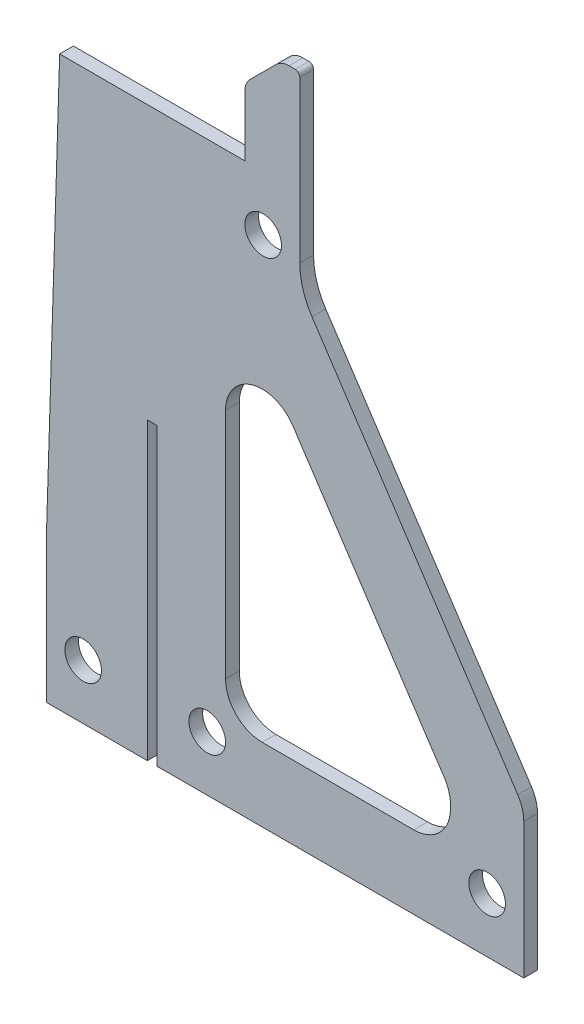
ISO-10303-21;
HEADER;
FILE_DESCRIPTION(('STEP AP214'),'2;1');
FILE_NAME('part.step','',(''),(''),'','','');
FILE_SCHEMA(('AUTOMOTIVE_DESIGN { 1 0 10303 214 1 1 1 1 }'));
ENDSEC;
DATA;
#1=APPLICATION_CONTEXT('core data for automotive mechanical design processes');
#2=APPLICATION_PROTOCOL_DEFINITION('international standard','automotive_design',2000,#1);
#3=PRODUCT_CONTEXT('',#1,'mechanical');
#4=PRODUCT('Part','Part','',(#3));
#5=PRODUCT_RELATED_PRODUCT_CATEGORY('part','',(#4));
#6=PRODUCT_DEFINITION_FORMATION('','',#4);
#7=PRODUCT_DEFINITION_CONTEXT('part definition',#1,'design');
#8=PRODUCT_DEFINITION('design','',#6,#7);
#9=PRODUCT_DEFINITION_SHAPE('','',#8);
#10=(LENGTH_UNIT() NAMED_UNIT(*) SI_UNIT(.MILLI.,.METRE.));
#11=(NAMED_UNIT(*) PLANE_ANGLE_UNIT() SI_UNIT($,.RADIAN.));
#12=(NAMED_UNIT(*) SI_UNIT($,.STERADIAN.) SOLID_ANGLE_UNIT());
#13=UNCERTAINTY_MEASURE_WITH_UNIT(LENGTH_MEASURE(1.E-05),#10,'distance_accuracy_value','');
#14=(GEOMETRIC_REPRESENTATION_CONTEXT(3) GLOBAL_UNCERTAINTY_ASSIGNED_CONTEXT((#13)) GLOBAL_UNIT_ASSIGNED_CONTEXT((#10,
#11,#12)) REPRESENTATION_CONTEXT('',''));
#15=CARTESIAN_POINT('',(0.,0.,0.));
#16=DIRECTION('',(0.,0.,1.));
#17=DIRECTION('',(1.,0.,0.));
#18=AXIS2_PLACEMENT_3D('',#15,#16,#17);
#19=CARTESIAN_POINT('',(76.835,435.429487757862,4.7625));
#20=DIRECTION('',(0.,0.,-1.));
#21=DIRECTION('',(-1.,0.,0.));
#22=AXIS2_PLACEMENT_3D('',#19,#20,#21);
#23=PLANE('',#22);
#24=DIRECTION('',(-0.0312890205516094,-0.999510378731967,0.));
#25=VECTOR('',#24,1.);
#26=CARTESIAN_POINT('',(-73.279,101.6,4.7625));
#27=LINE('',#26,#25);
#28=CARTESIAN_POINT('',(-64.135,393.7,4.7625));
#29=VERTEX_POINT('',#28);
#30=CARTESIAN_POINT('',(-73.266563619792,101.997273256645,4.7625));
#31=VERTEX_POINT('',#30);
#32=EDGE_CURVE('E372',#29,#31,#27,.T.);
#33=ORIENTED_EDGE('',*,*,#32,.T.);
#34=CARTESIAN_POINT('',(-47.879,101.202532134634,4.7625));
#35=DIRECTION('',(0.,0.,-1.));
#36=DIRECTION('',(-1.,0.,0.));
#37=AXIS2_PLACEMENT_3D('',#34,#35,#36);
#38=CIRCLE('',#37,25.4);
#39=CARTESIAN_POINT('',(-73.279,101.202532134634,4.7625));
#40=VERTEX_POINT('',#39);
#41=EDGE_CURVE('E501',#31,#40,#38,.F.);
#42=ORIENTED_EDGE('',*,*,#41,.T.);
#43=DIRECTION('',(0.,-1.,0.));
#44=VECTOR('',#43,1.);
#45=CARTESIAN_POINT('',(-73.279,0.,4.7625));
#46=LINE('',#45,#44);
#47=CARTESIAN_POINT('',(-73.279,0.,4.7625));
#48=VERTEX_POINT('',#47);
#49=EDGE_CURVE('E375',#40,#48,#46,.T.);
#50=ORIENTED_EDGE('',*,*,#49,.T.);
#51=DIRECTION('',(1.,0.,0.));
#52=VECTOR('',#51,1.);
#53=CARTESIAN_POINT('',(-3.429,0.,4.7625));
#54=LINE('',#53,#52);
#55=CARTESIAN_POINT('',(-3.429,0.,4.7625));
#56=VERTEX_POINT('',#55);
#57=EDGE_CURVE('E378',#48,#56,#54,.T.);
#58=ORIENTED_EDGE('',*,*,#57,.T.);
#59=DIRECTION('',(0.,1.,0.));
#60=VECTOR('',#59,1.);
#61=CARTESIAN_POINT('',(-3.429,0.,4.7625));
#62=LINE('',#61,#60);
#63=CARTESIAN_POINT('',(-3.429,204.47,4.7625));
#64=VERTEX_POINT('',#63);
#65=EDGE_CURVE('E381',#56,#64,#62,.T.);
#66=ORIENTED_EDGE('',*,*,#65,.T.);
#67=DIRECTION('',(1.,0.,0.));
#68=VECTOR('',#67,1.);
#69=CARTESIAN_POINT('',(-3.429,204.47,4.7625));
#70=LINE('',#69,#68);
#71=CARTESIAN_POINT('',(3.429,204.47,4.7625));
#72=VERTEX_POINT('',#71);
#73=EDGE_CURVE('E384',#64,#72,#70,.T.);
#74=ORIENTED_EDGE('',*,*,#73,.T.);
#75=DIRECTION('',(0.,-1.,0.));
#76=VECTOR('',#75,1.);
#77=CARTESIAN_POINT('',(3.429,0.,4.7625));
#78=LINE('',#77,#76);
#79=CARTESIAN_POINT('',(3.429,0.,4.7625));
#80=VERTEX_POINT('',#79);
#81=EDGE_CURVE('E386',#72,#80,#78,.T.);
#82=ORIENTED_EDGE('',*,*,#81,.T.);
#83=DIRECTION('',(1.,0.,0.));
#84=VECTOR('',#83,1.);
#85=CARTESIAN_POINT('',(257.429,0.,4.7625));
#86=LINE('',#85,#84);
#87=CARTESIAN_POINT('',(257.429,0.,4.7625));
#88=VERTEX_POINT('',#87);
#89=EDGE_CURVE('E339',#80,#88,#86,.T.);
#90=ORIENTED_EDGE('',*,*,#89,.T.);
#91=DIRECTION('',(0.,1.,0.));
#92=VECTOR('',#91,1.);
#93=CARTESIAN_POINT('',(257.429,0.,4.7625));
#94=LINE('',#93,#92);
#95=CARTESIAN_POINT('',(257.429,93.9568780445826,4.7625));
#96=VERTEX_POINT('',#95);
#97=EDGE_CURVE('E343',#88,#96,#94,.T.);
#98=ORIENTED_EDGE('',*,*,#97,.T.);
#99=CARTESIAN_POINT('',(232.029,93.9568780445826,4.7625));
#100=DIRECTION('',(0.,0.,-1.));
#101=DIRECTION('',(-1.,0.,0.));
#102=AXIS2_PLACEMENT_3D('',#99,#100,#101);
#103=CIRCLE('',#102,25.4);
#104=CARTESIAN_POINT('',(253.211127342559,107.973920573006,4.7625));
#105=VERTEX_POINT('',#104);
#106=EDGE_CURVE('E58',#96,#105,#103,.F.);
#107=ORIENTED_EDGE('',*,*,#106,.T.);
#108=DIRECTION('',(-0.55185206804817,0.833942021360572,0.));
#109=VECTOR('',#108,1.);
#110=CARTESIAN_POINT('',(257.429,101.6,4.7625));
#111=LINE('',#110,#109);
#112=CARTESIAN_POINT('',(110.670745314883,323.376600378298,4.7625));
#113=VERTEX_POINT('',#112);
#114=EDGE_CURVE('E347',#105,#113,#111,.T.);
#115=ORIENTED_EDGE('',*,*,#114,.T.);
#116=CARTESIAN_POINT('',(153.035,351.410685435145,4.7625));
#117=DIRECTION('',(0.,0.,-1.));
#118=DIRECTION('',(-1.,0.,0.));
#119=AXIS2_PLACEMENT_3D('',#116,#117,#118);
#120=CIRCLE('',#119,50.8);
#121=CARTESIAN_POINT('',(102.235,351.410685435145,4.7625));
#122=VERTEX_POINT('',#121);
#123=EDGE_CURVE('E350',#113,#122,#120,.T.);
#124=ORIENTED_EDGE('',*,*,#123,.T.);
#125=DIRECTION('',(0.,1.,0.));
#126=VECTOR('',#125,1.);
#127=CARTESIAN_POINT('',(102.235,462.915,4.7625));
#128=LINE('',#127,#126);
#129=CARTESIAN_POINT('',(102.235,462.915,4.7625));
#130=VERTEX_POINT('',#129);
#131=EDGE_CURVE('E353',#122,#130,#128,.T.);
#132=ORIENTED_EDGE('',*,*,#131,.T.);
#133=CARTESIAN_POINT('',(99.06,462.915,4.7625));
#134=DIRECTION('',(0.,0.,1.));
#135=DIRECTION('',(1.,0.,0.));
#136=AXIS2_PLACEMENT_3D('',#133,#134,#135);
#137=CIRCLE('',#136,3.17499999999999);
#138=CARTESIAN_POINT('',(99.06,466.09,4.7625));
#139=VERTEX_POINT('',#138);
#140=EDGE_CURVE('E356',#130,#139,#137,.T.);
#141=ORIENTED_EDGE('',*,*,#140,.T.);
#142=DIRECTION('',(-1.,0.,0.));
#143=VECTOR('',#142,1.);
#144=CARTESIAN_POINT('',(94.7955122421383,466.09,4.7625));
#145=LINE('',#144,#143);
#146=CARTESIAN_POINT('',(94.7955122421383,466.09,4.7625));
#147=VERTEX_POINT('',#146);
#148=EDGE_CURVE('E358',#139,#147,#145,.T.);
#149=ORIENTED_EDGE('',*,*,#148,.T.);
#150=CARTESIAN_POINT('',(94.7955122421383,453.39,4.7625));
#151=DIRECTION('',(0.,0.,1.));
#152=DIRECTION('',(1.,0.,0.));
#153=AXIS2_PLACEMENT_3D('',#150,#151,#152);
#154=CIRCLE('',#153,12.7);
#155=CARTESIAN_POINT('',(85.8152561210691,462.370256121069,4.7625));
#156=VERTEX_POINT('',#155);
#157=EDGE_CURVE('E360',#147,#156,#154,.T.);
#158=ORIENTED_EDGE('',*,*,#157,.T.);
#159=DIRECTION('',(-0.707106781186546,-0.707106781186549,0.));
#160=VECTOR('',#159,1.);
#161=CARTESIAN_POINT('',(67.8547438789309,444.409743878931,4.7625));
#162=LINE('',#161,#160);
#163=CARTESIAN_POINT('',(67.8547438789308,444.409743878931,4.7625));
#164=VERTEX_POINT('',#163);
#165=EDGE_CURVE('E362',#156,#164,#162,.T.);
#166=ORIENTED_EDGE('',*,*,#165,.T.);
#167=CARTESIAN_POINT('',(76.835,435.429487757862,4.7625));
#168=DIRECTION('',(0.,0.,1.));
#169=DIRECTION('',(-1.,0.,0.));
#170=AXIS2_PLACEMENT_3D('',#167,#168,#169);
#171=CIRCLE('',#170,12.7);
#172=CARTESIAN_POINT('',(64.135,435.429487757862,4.7625));
#173=VERTEX_POINT('',#172);
#174=EDGE_CURVE('E364',#164,#173,#171,.T.);
#175=ORIENTED_EDGE('',*,*,#174,.T.);
#176=DIRECTION('',(0.,-1.,0.));
#177=VECTOR('',#176,1.);
#178=CARTESIAN_POINT('',(64.135,393.7,4.7625));
#179=LINE('',#178,#177);
#180=CARTESIAN_POINT('',(64.135,393.7,4.7625));
#181=VERTEX_POINT('',#180);
#182=EDGE_CURVE('E366',#173,#181,#179,.T.);
#183=ORIENTED_EDGE('',*,*,#182,.T.);
#184=DIRECTION('',(-1.,0.,0.));
#185=VECTOR('',#184,1.);
#186=CARTESIAN_POINT('',(-64.135,393.7,4.7625));
#187=LINE('',#186,#185);
#188=EDGE_CURVE('E369',#181,#29,#187,.T.);
#189=ORIENTED_EDGE('',*,*,#188,.T.);
#190=EDGE_LOOP('',(#33,#42,#50,#58,#66,#74,#82,#90,#98,#107,#115,#124,#132,#141,#149,#158,#166,
#175,#183,#189));
#191=FACE_BOUND('',#190,.T.);
#192=CARTESIAN_POINT('',(181.229,76.2,4.7625));
#193=DIRECTION('',(0.,0.,1.));
#194=DIRECTION('',(-1.,0.,0.));
#195=AXIS2_PLACEMENT_3D('',#192,#193,#194);
#196=CIRCLE('',#195,25.4);
#197=CARTESIAN_POINT('',(181.229,50.8,4.7625));
#198=VERTEX_POINT('',#197);
#199=CARTESIAN_POINT('',(206.629,76.2000000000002,4.7625));
#200=VERTEX_POINT('',#199);
#201=EDGE_CURVE('E249',#198,#200,#196,.T.);
#202=ORIENTED_EDGE('',*,*,#201,.F.);
#203=DIRECTION('',(1.,0.,0.));
#204=VECTOR('',#203,1.);
#205=CARTESIAN_POINT('',(181.229,50.8,4.7625));
#206=LINE('',#205,#204);
#207=CARTESIAN_POINT('',(76.2000000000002,50.8,4.7625));
#208=VERTEX_POINT('',#207);
#209=EDGE_CURVE('E295',#208,#198,#206,.T.);
#210=ORIENTED_EDGE('',*,*,#209,.F.);
#211=CARTESIAN_POINT('',(76.2,76.2,4.7625));
#212=DIRECTION('',(0.,0.,1.));
#213=DIRECTION('',(-1.,0.,0.));
#214=AXIS2_PLACEMENT_3D('',#211,#212,#213);
#215=CIRCLE('',#214,25.4);
#216=CARTESIAN_POINT('',(50.8,76.2000000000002,4.7625));
#217=VERTEX_POINT('',#216);
#218=EDGE_CURVE('E291',#217,#208,#215,.T.);
#219=ORIENTED_EDGE('',*,*,#218,.F.);
#220=DIRECTION('',(0.,-1.,0.));
#221=VECTOR('',#220,1.);
#222=CARTESIAN_POINT('',(50.8,237.3872569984,4.7625));
#223=LINE('',#222,#221);
#224=CARTESIAN_POINT('',(50.8,237.3872569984,4.7625));
#225=VERTEX_POINT('',#224);
#226=EDGE_CURVE('E289',#225,#217,#223,.T.);
#227=ORIENTED_EDGE('',*,*,#226,.F.);
#228=CARTESIAN_POINT('',(76.2,237.3872569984,4.7625));
#229=DIRECTION('',(0.,0.,1.));
#230=DIRECTION('',(1.,0.,0.));
#231=AXIS2_PLACEMENT_3D('',#228,#229,#230);
#232=CIRCLE('',#231,25.4);
#233=CARTESIAN_POINT('',(97.3821273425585,251.404299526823,4.7625));
#234=VERTEX_POINT('',#233);
#235=EDGE_CURVE('E287',#234,#225,#232,.T.);
#236=ORIENTED_EDGE('',*,*,#235,.F.);
#237=DIRECTION('',(-0.55185206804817,0.833942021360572,0.));
#238=VECTOR('',#237,1.);
#239=CARTESIAN_POINT('',(202.411127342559,92.6876766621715,4.7625));
#240=LINE('',#239,#238);
#241=CARTESIAN_POINT('',(202.411127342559,92.6876766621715,4.7625));
#242=VERTEX_POINT('',#241);
#243=EDGE_CURVE('E281',#242,#234,#240,.T.);
#244=ORIENTED_EDGE('',*,*,#243,.F.);
#245=CARTESIAN_POINT('',(181.229,78.6706341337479,4.7625));
#246=DIRECTION('',(0.,0.,1.));
#247=DIRECTION('',(1.,0.,0.));
#248=AXIS2_PLACEMENT_3D('',#245,#246,#247);
#249=CIRCLE('',#248,25.4);
#250=CARTESIAN_POINT('',(206.629,78.6706341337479,4.7625));
#251=VERTEX_POINT('',#250);
#252=EDGE_CURVE('E275',#251,#242,#249,.T.);
#253=ORIENTED_EDGE('',*,*,#252,.F.);
#254=DIRECTION('',(0.,1.,0.));
#255=VECTOR('',#254,1.);
#256=CARTESIAN_POINT('',(206.629,76.2000000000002,4.7625));
#257=LINE('',#256,#255);
#258=EDGE_CURVE('E260',#200,#251,#257,.T.);
#259=ORIENTED_EDGE('',*,*,#258,.F.);
#260=EDGE_LOOP('',(#202,#210,#219,#227,#236,#244,#253,#259));
#261=FACE_BOUND('',#260,.T.);
#262=CARTESIAN_POINT('',(-47.879,38.1,4.7625));
#263=DIRECTION('',(0.,0.,1.));
#264=DIRECTION('',(1.,0.,0.));
#265=AXIS2_PLACEMENT_3D('',#262,#263,#264);
#266=CIRCLE('',#265,12.7);
#267=CARTESIAN_POINT('',(-60.579,38.1,4.7625));
#268=VERTEX_POINT('',#267);
#269=EDGE_CURVE('E301',#268,#268,#266,.T.);
#270=ORIENTED_EDGE('',*,*,#269,.F.);
#271=EDGE_LOOP('',(#270));
#272=FACE_BOUND('',#271,.T.);
#273=CARTESIAN_POINT('',(76.835,355.6,4.7625));
#274=DIRECTION('',(0.,0.,1.));
#275=DIRECTION('',(1.,0.,0.));
#276=AXIS2_PLACEMENT_3D('',#273,#274,#275);
#277=CIRCLE('',#276,12.7);
#278=CARTESIAN_POINT('',(64.135,355.6,4.7625));
#279=VERTEX_POINT('',#278);
#280=EDGE_CURVE('E913',#279,#279,#277,.T.);
#281=ORIENTED_EDGE('',*,*,#280,.F.);
#282=EDGE_LOOP('',(#281));
#283=FACE_BOUND('',#282,.T.);
#284=CARTESIAN_POINT('',(38.1,38.1,4.7625));
#285=DIRECTION('',(0.,0.,1.));
#286=DIRECTION('',(1.,0.,0.));
#287=AXIS2_PLACEMENT_3D('',#284,#285,#286);
#288=CIRCLE('',#287,12.7);
#289=CARTESIAN_POINT('',(25.4,38.1,4.7625));
#290=VERTEX_POINT('',#289);
#291=EDGE_CURVE('E905',#290,#290,#288,.T.);
#292=ORIENTED_EDGE('',*,*,#291,.F.);
#293=EDGE_LOOP('',(#292));
#294=FACE_BOUND('',#293,.T.);
#295=CARTESIAN_POINT('',(232.029,38.1,4.7625));
#296=DIRECTION('',(0.,0.,1.));
#297=DIRECTION('',(1.,0.,0.));
#298=AXIS2_PLACEMENT_3D('',#295,#296,#297);
#299=CIRCLE('',#298,12.7);
#300=CARTESIAN_POINT('',(219.329,38.1,4.7625));
#301=VERTEX_POINT('',#300);
#302=EDGE_CURVE('E894',#301,#301,#299,.T.);
#303=ORIENTED_EDGE('',*,*,#302,.F.);
#304=EDGE_LOOP('',(#303));
#305=FACE_BOUND('',#304,.T.);
#306=ADVANCED_FACE('F39',(#191,#261,#272,#283,#294,#305),#23,.F.);
#307=CARTESIAN_POINT('',(76.835,435.429487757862,-4.7625));
#308=DIRECTION('',(0.,0.,-1.));
#309=DIRECTION('',(-1.,0.,0.));
#310=AXIS2_PLACEMENT_3D('',#307,#308,#309);
#311=PLANE('',#310);
#312=CARTESIAN_POINT('',(38.1,38.1,-4.7625));
#313=DIRECTION('',(0.,0.,1.));
#314=DIRECTION('',(1.,0.,0.));
#315=AXIS2_PLACEMENT_3D('',#312,#313,#314);
#316=CIRCLE('',#315,12.7);
#317=CARTESIAN_POINT('',(25.4,38.1,-4.7625));
#318=VERTEX_POINT('',#317);
#319=EDGE_CURVE('E902',#318,#318,#316,.T.);
#320=ORIENTED_EDGE('',*,*,#319,.T.);
#321=EDGE_LOOP('',(#320));
#322=FACE_BOUND('',#321,.T.);
#323=CARTESIAN_POINT('',(-47.879,38.1,-4.7625));
#324=DIRECTION('',(0.,0.,1.));
#325=DIRECTION('',(1.,0.,0.));
#326=AXIS2_PLACEMENT_3D('',#323,#324,#325);
#327=CIRCLE('',#326,12.7);
#328=CARTESIAN_POINT('',(-60.579,38.1,-4.7625));
#329=VERTEX_POINT('',#328);
#330=EDGE_CURVE('E917',#329,#329,#327,.T.);
#331=ORIENTED_EDGE('',*,*,#330,.T.);
#332=EDGE_LOOP('',(#331));
#333=FACE_BOUND('',#332,.T.);
#334=DIRECTION('',(0.,-1.,0.));
#335=VECTOR('',#334,1.);
#336=CARTESIAN_POINT('',(-73.279,0.,-4.7625));
#337=LINE('',#336,#335);
#338=CARTESIAN_POINT('',(-73.279,101.202532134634,-4.7625));
#339=VERTEX_POINT('',#338);
#340=CARTESIAN_POINT('',(-73.279,0.,-4.7625));
#341=VERTEX_POINT('',#340);
#342=EDGE_CURVE('E424',#339,#341,#337,.T.);
#343=ORIENTED_EDGE('',*,*,#342,.F.);
#344=CARTESIAN_POINT('',(-47.879,101.202532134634,-4.7625));
#345=DIRECTION('',(0.,0.,-1.));
#346=DIRECTION('',(-1.,0.,0.));
#347=AXIS2_PLACEMENT_3D('',#344,#345,#346);
#348=CIRCLE('',#347,25.4);
#349=CARTESIAN_POINT('',(-73.266563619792,101.997273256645,-4.7625));
#350=VERTEX_POINT('',#349);
#351=EDGE_CURVE('E495',#339,#350,#348,.T.);
#352=ORIENTED_EDGE('',*,*,#351,.T.);
#353=DIRECTION('',(-0.0312890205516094,-0.999510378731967,0.));
#354=VECTOR('',#353,1.);
#355=CARTESIAN_POINT('',(-73.279,101.6,-4.7625));
#356=LINE('',#355,#354);
#357=CARTESIAN_POINT('',(-64.135,393.7,-4.7625));
#358=VERTEX_POINT('',#357);
#359=EDGE_CURVE('E421',#358,#350,#356,.T.);
#360=ORIENTED_EDGE('',*,*,#359,.F.);
#361=DIRECTION('',(-1.,0.,0.));
#362=VECTOR('',#361,1.);
#363=CARTESIAN_POINT('',(-64.135,393.7,-4.7625));
#364=LINE('',#363,#362);
#365=CARTESIAN_POINT('',(64.135,393.7,-4.7625));
#366=VERTEX_POINT('',#365);
#367=EDGE_CURVE('E418',#366,#358,#364,.T.);
#368=ORIENTED_EDGE('',*,*,#367,.F.);
#369=DIRECTION('',(0.,-1.,0.));
#370=VECTOR('',#369,1.);
#371=CARTESIAN_POINT('',(64.135,393.7,-4.7625));
#372=LINE('',#371,#370);
#373=CARTESIAN_POINT('',(64.135,435.429487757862,-4.7625));
#374=VERTEX_POINT('',#373);
#375=EDGE_CURVE('E415',#374,#366,#372,.T.);
#376=ORIENTED_EDGE('',*,*,#375,.F.);
#377=CARTESIAN_POINT('',(76.835,435.429487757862,-4.7625));
#378=DIRECTION('',(0.,0.,1.));
#379=DIRECTION('',(-1.,0.,0.));
#380=AXIS2_PLACEMENT_3D('',#377,#378,#379);
#381=CIRCLE('',#380,12.7);
#382=CARTESIAN_POINT('',(67.8547438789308,444.409743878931,-4.7625));
#383=VERTEX_POINT('',#382);
#384=EDGE_CURVE('E413',#383,#374,#381,.T.);
#385=ORIENTED_EDGE('',*,*,#384,.F.);
#386=DIRECTION('',(-0.707106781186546,-0.707106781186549,0.));
#387=VECTOR('',#386,1.);
#388=CARTESIAN_POINT('',(67.8547438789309,444.409743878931,-4.7625));
#389=LINE('',#388,#387);
#390=CARTESIAN_POINT('',(85.8152561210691,462.370256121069,-4.7625));
#391=VERTEX_POINT('',#390);
#392=EDGE_CURVE('E411',#391,#383,#389,.T.);
#393=ORIENTED_EDGE('',*,*,#392,.F.);
#394=CARTESIAN_POINT('',(94.7955122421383,453.39,-4.7625));
#395=DIRECTION('',(0.,0.,1.));
#396=DIRECTION('',(1.,0.,0.));
#397=AXIS2_PLACEMENT_3D('',#394,#395,#396);
#398=CIRCLE('',#397,12.7);
#399=CARTESIAN_POINT('',(94.7955122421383,466.09,-4.7625));
#400=VERTEX_POINT('',#399);
#401=EDGE_CURVE('E409',#400,#391,#398,.T.);
#402=ORIENTED_EDGE('',*,*,#401,.F.);
#403=DIRECTION('',(-1.,0.,0.));
#404=VECTOR('',#403,1.);
#405=CARTESIAN_POINT('',(94.7955122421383,466.09,-4.7625));
#406=LINE('',#405,#404);
#407=CARTESIAN_POINT('',(99.06,466.09,-4.7625));
#408=VERTEX_POINT('',#407);
#409=EDGE_CURVE('E407',#408,#400,#406,.T.);
#410=ORIENTED_EDGE('',*,*,#409,.F.);
#411=CARTESIAN_POINT('',(99.06,462.915,-4.7625));
#412=DIRECTION('',(0.,0.,1.));
#413=DIRECTION('',(1.,0.,0.));
#414=AXIS2_PLACEMENT_3D('',#411,#412,#413);
#415=CIRCLE('',#414,3.17499999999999);
#416=CARTESIAN_POINT('',(102.235,462.915,-4.7625));
#417=VERTEX_POINT('',#416);
#418=EDGE_CURVE('E405',#417,#408,#415,.T.);
#419=ORIENTED_EDGE('',*,*,#418,.F.);
#420=DIRECTION('',(0.,1.,0.));
#421=VECTOR('',#420,1.);
#422=CARTESIAN_POINT('',(102.235,462.915,-4.7625));
#423=LINE('',#422,#421);
#424=CARTESIAN_POINT('',(102.235,351.410685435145,-4.7625));
#425=VERTEX_POINT('',#424);
#426=EDGE_CURVE('E402',#425,#417,#423,.T.);
#427=ORIENTED_EDGE('',*,*,#426,.F.);
#428=CARTESIAN_POINT('',(153.035,351.410685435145,-4.7625));
#429=DIRECTION('',(0.,0.,-1.));
#430=DIRECTION('',(-1.,0.,0.));
#431=AXIS2_PLACEMENT_3D('',#428,#429,#430);
#432=CIRCLE('',#431,50.8);
#433=CARTESIAN_POINT('',(110.670745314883,323.376600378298,-4.7625));
#434=VERTEX_POINT('',#433);
#435=EDGE_CURVE('E399',#434,#425,#432,.T.);
#436=ORIENTED_EDGE('',*,*,#435,.F.);
#437=DIRECTION('',(-0.55185206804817,0.833942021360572,0.));
#438=VECTOR('',#437,1.);
#439=CARTESIAN_POINT('',(257.429,101.6,-4.7625));
#440=LINE('',#439,#438);
#441=CARTESIAN_POINT('',(253.211127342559,107.973920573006,-4.7625));
#442=VERTEX_POINT('',#441);
#443=EDGE_CURVE('E396',#442,#434,#440,.T.);
#444=ORIENTED_EDGE('',*,*,#443,.F.);
#445=CARTESIAN_POINT('',(232.029,93.9568780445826,-4.7625));
#446=DIRECTION('',(0.,0.,-1.));
#447=DIRECTION('',(-1.,0.,0.));
#448=AXIS2_PLACEMENT_3D('',#445,#446,#447);
#449=CIRCLE('',#448,25.4);
#450=CARTESIAN_POINT('',(257.429,93.9568780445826,-4.7625));
#451=VERTEX_POINT('',#450);
#452=EDGE_CURVE('E492',#442,#451,#449,.T.);
#453=ORIENTED_EDGE('',*,*,#452,.T.);
#454=DIRECTION('',(0.,1.,0.));
#455=VECTOR('',#454,1.);
#456=CARTESIAN_POINT('',(257.429,0.,-4.7625));
#457=LINE('',#456,#455);
#458=CARTESIAN_POINT('',(257.429,0.,-4.7625));
#459=VERTEX_POINT('',#458);
#460=EDGE_CURVE('E393',#459,#451,#457,.T.);
#461=ORIENTED_EDGE('',*,*,#460,.F.);
#462=DIRECTION('',(1.,0.,0.));
#463=VECTOR('',#462,1.);
#464=CARTESIAN_POINT('',(257.429,0.,-4.7625));
#465=LINE('',#464,#463);
#466=CARTESIAN_POINT('',(3.429,0.,-4.7625));
#467=VERTEX_POINT('',#466);
#468=EDGE_CURVE('E269',#467,#459,#465,.T.);
#469=ORIENTED_EDGE('',*,*,#468,.F.);
#470=DIRECTION('',(0.,-1.,0.));
#471=VECTOR('',#470,1.);
#472=CARTESIAN_POINT('',(3.429,0.,-4.7625));
#473=LINE('',#472,#471);
#474=CARTESIAN_POINT('',(3.429,204.47,-4.7625));
#475=VERTEX_POINT('',#474);
#476=EDGE_CURVE('E344',#475,#467,#473,.T.);
#477=ORIENTED_EDGE('',*,*,#476,.F.);
#478=DIRECTION('',(1.,0.,0.));
#479=VECTOR('',#478,1.);
#480=CARTESIAN_POINT('',(-3.429,204.47,-4.7625));
#481=LINE('',#480,#479);
#482=CARTESIAN_POINT('',(-3.429,204.47,-4.7625));
#483=VERTEX_POINT('',#482);
#484=EDGE_CURVE('E433',#483,#475,#481,.T.);
#485=ORIENTED_EDGE('',*,*,#484,.F.);
#486=DIRECTION('',(0.,1.,0.));
#487=VECTOR('',#486,1.);
#488=CARTESIAN_POINT('',(-3.429,0.,-4.7625));
#489=LINE('',#488,#487);
#490=CARTESIAN_POINT('',(-3.429,0.,-4.7625));
#491=VERTEX_POINT('',#490);
#492=EDGE_CURVE('E430',#491,#483,#489,.T.);
#493=ORIENTED_EDGE('',*,*,#492,.F.);
#494=DIRECTION('',(1.,0.,0.));
#495=VECTOR('',#494,1.);
#496=CARTESIAN_POINT('',(-3.429,0.,-4.7625));
#497=LINE('',#496,#495);
#498=EDGE_CURVE('E427',#341,#491,#497,.T.);
#499=ORIENTED_EDGE('',*,*,#498,.F.);
#500=EDGE_LOOP('',(#343,#352,#360,#368,#376,#385,#393,#402,#410,#419,#427,#436,#444,#453,#461,
#469,#477,#485,#493,#499));
#501=FACE_BOUND('',#500,.T.);
#502=DIRECTION('',(1.,0.,0.));
#503=VECTOR('',#502,1.);
#504=CARTESIAN_POINT('',(181.229,50.8,-4.7625));
#505=LINE('',#504,#503);
#506=CARTESIAN_POINT('',(76.2000000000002,50.8,-4.7625));
#507=VERTEX_POINT('',#506);
#508=CARTESIAN_POINT('',(181.229,50.8,-4.7625));
#509=VERTEX_POINT('',#508);
#510=EDGE_CURVE('E261',#507,#509,#505,.T.);
#511=ORIENTED_EDGE('',*,*,#510,.T.);
#512=CARTESIAN_POINT('',(181.229,76.2,-4.7625));
#513=DIRECTION('',(0.,0.,1.));
#514=DIRECTION('',(-1.,0.,0.));
#515=AXIS2_PLACEMENT_3D('',#512,#513,#514);
#516=CIRCLE('',#515,25.4);
#517=CARTESIAN_POINT('',(206.629,76.2000000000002,-4.7625));
#518=VERTEX_POINT('',#517);
#519=EDGE_CURVE('E298',#509,#518,#516,.T.);
#520=ORIENTED_EDGE('',*,*,#519,.T.);
#521=DIRECTION('',(0.,1.,0.));
#522=VECTOR('',#521,1.);
#523=CARTESIAN_POINT('',(206.629,76.2000000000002,-4.7625));
#524=LINE('',#523,#522);
#525=CARTESIAN_POINT('',(206.629,78.6706341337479,-4.7625));
#526=VERTEX_POINT('',#525);
#527=EDGE_CURVE('E267',#518,#526,#524,.T.);
#528=ORIENTED_EDGE('',*,*,#527,.T.);
#529=CARTESIAN_POINT('',(181.229,78.6706341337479,-4.7625));
#530=DIRECTION('',(0.,0.,1.));
#531=DIRECTION('',(1.,0.,0.));
#532=AXIS2_PLACEMENT_3D('',#529,#530,#531);
#533=CIRCLE('',#532,25.4);
#534=CARTESIAN_POINT('',(202.411127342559,92.6876766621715,-4.7625));
#535=VERTEX_POINT('',#534);
#536=EDGE_CURVE('E303',#526,#535,#533,.T.);
#537=ORIENTED_EDGE('',*,*,#536,.T.);
#538=DIRECTION('',(-0.55185206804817,0.833942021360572,0.));
#539=VECTOR('',#538,1.);
#540=CARTESIAN_POINT('',(202.411127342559,92.6876766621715,-4.7625));
#541=LINE('',#540,#539);
#542=CARTESIAN_POINT('',(97.3821273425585,251.404299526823,-4.7625));
#543=VERTEX_POINT('',#542);
#544=EDGE_CURVE('E307',#535,#543,#541,.T.);
#545=ORIENTED_EDGE('',*,*,#544,.T.);
#546=CARTESIAN_POINT('',(76.2,237.3872569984,-4.7625));
#547=DIRECTION('',(0.,0.,1.));
#548=DIRECTION('',(1.,0.,0.));
#549=AXIS2_PLACEMENT_3D('',#546,#547,#548);
#550=CIRCLE('',#549,25.4);
#551=CARTESIAN_POINT('',(50.8,237.3872569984,-4.7625));
#552=VERTEX_POINT('',#551);
#553=EDGE_CURVE('E311',#543,#552,#550,.T.);
#554=ORIENTED_EDGE('',*,*,#553,.T.);
#555=DIRECTION('',(0.,-1.,0.));
#556=VECTOR('',#555,1.);
#557=CARTESIAN_POINT('',(50.8,237.3872569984,-4.7625));
#558=LINE('',#557,#556);
#559=CARTESIAN_POINT('',(50.8,76.2000000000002,-4.7625));
#560=VERTEX_POINT('',#559);
#561=EDGE_CURVE('E314',#552,#560,#558,.T.);
#562=ORIENTED_EDGE('',*,*,#561,.T.);
#563=CARTESIAN_POINT('',(76.2,76.2,-4.7625));
#564=DIRECTION('',(0.,0.,1.));
#565=DIRECTION('',(-1.,0.,0.));
#566=AXIS2_PLACEMENT_3D('',#563,#564,#565);
#567=CIRCLE('',#566,25.4);
#568=EDGE_CURVE('E317',#560,#507,#567,.T.);
#569=ORIENTED_EDGE('',*,*,#568,.T.);
#570=EDGE_LOOP('',(#511,#520,#528,#537,#545,#554,#562,#569));
#571=FACE_BOUND('',#570,.T.);
#572=CARTESIAN_POINT('',(76.835,355.6,-4.7625));
#573=DIRECTION('',(0.,0.,1.));
#574=DIRECTION('',(1.,0.,0.));
#575=AXIS2_PLACEMENT_3D('',#572,#573,#574);
#576=CIRCLE('',#575,12.7);
#577=CARTESIAN_POINT('',(64.135,355.6,-4.7625));
#578=VERTEX_POINT('',#577);
#579=EDGE_CURVE('E909',#578,#578,#576,.T.);
#580=ORIENTED_EDGE('',*,*,#579,.T.);
#581=EDGE_LOOP('',(#580));
#582=FACE_BOUND('',#581,.T.);
#583=CARTESIAN_POINT('',(232.029,38.1,-4.7625));
#584=DIRECTION('',(0.,0.,1.));
#585=DIRECTION('',(1.,0.,0.));
#586=AXIS2_PLACEMENT_3D('',#583,#584,#585);
#587=CIRCLE('',#586,12.7);
#588=CARTESIAN_POINT('',(219.329,38.1,-4.7625));
#589=VERTEX_POINT('',#588);
#590=EDGE_CURVE('E897',#589,#589,#587,.T.);
#591=ORIENTED_EDGE('',*,*,#590,.T.);
#592=EDGE_LOOP('',(#591));
#593=FACE_BOUND('',#592,.T.);
#594=ADVANCED_FACE('F513',(#322,#333,#501,#571,#582,#593),#311,.T.);
#595=CARTESIAN_POINT('',(257.429,0.,4.7625));
#596=DIRECTION('',(0.,1.,0.));
#597=DIRECTION('',(-1.,0.,0.));
#598=AXIS2_PLACEMENT_3D('',#595,#596,#597);
#599=PLANE('',#598);
#600=ORIENTED_EDGE('',*,*,#468,.T.);
#601=DIRECTION('',(0.,0.,-1.));
#602=VECTOR('',#601,1.);
#603=CARTESIAN_POINT('',(257.429,0.,4.7625));
#604=LINE('',#603,#602);
#605=EDGE_CURVE('E486',#88,#459,#604,.T.);
#606=ORIENTED_EDGE('',*,*,#605,.F.);
#607=ORIENTED_EDGE('',*,*,#89,.F.);
#608=DIRECTION('',(0.,0.,-1.));
#609=VECTOR('',#608,1.);
#610=CARTESIAN_POINT('',(3.429,0.,4.7625));
#611=LINE('',#610,#609);
#612=EDGE_CURVE('E389',#80,#467,#611,.T.);
#613=ORIENTED_EDGE('',*,*,#612,.T.);
#614=EDGE_LOOP('',(#600,#606,#607,#613));
#615=FACE_BOUND('',#614,.T.);
#616=ADVANCED_FACE('F595',(#615),#599,.F.);
#617=CARTESIAN_POINT('',(257.429,0.,4.7625));
#618=DIRECTION('',(-1.,0.,0.));
#619=DIRECTION('',(0.,0.,1.));
#620=AXIS2_PLACEMENT_3D('',#617,#618,#619);
#621=PLANE('',#620);
#622=ORIENTED_EDGE('',*,*,#460,.T.);
#623=DIRECTION('',(0.,0.,-1.));
#624=VECTOR('',#623,1.);
#625=CARTESIAN_POINT('',(257.429,93.9568780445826,4.7625));
#626=LINE('',#625,#624);
#627=EDGE_CURVE('E11',#451,#96,#626,.F.);
#628=ORIENTED_EDGE('',*,*,#627,.T.);
#629=ORIENTED_EDGE('',*,*,#97,.F.);
#630=ORIENTED_EDGE('',*,*,#605,.T.);
#631=EDGE_LOOP('',(#622,#628,#629,#630));
#632=FACE_BOUND('',#631,.T.);
#633=ADVANCED_FACE('F597',(#632),#621,.F.);
#634=CARTESIAN_POINT('',(257.429,101.6,4.7625));
#635=DIRECTION('',(-0.833942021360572,-0.55185206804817,0.));
#636=DIRECTION('',(0.551852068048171,-0.833942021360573,0.));
#637=AXIS2_PLACEMENT_3D('',#634,#635,#636);
#638=PLANE('',#637);
#639=ORIENTED_EDGE('',*,*,#114,.F.);
#640=DIRECTION('',(0.,0.,-1.));
#641=VECTOR('',#640,1.);
#642=CARTESIAN_POINT('',(253.211127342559,107.973920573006,4.7625));
#643=LINE('',#642,#641);
#644=EDGE_CURVE('E48',#105,#442,#643,.T.);
#645=ORIENTED_EDGE('',*,*,#644,.T.);
#646=ORIENTED_EDGE('',*,*,#443,.T.);
#647=DIRECTION('',(0.,0.,-1.));
#648=VECTOR('',#647,1.);
#649=CARTESIAN_POINT('',(110.670745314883,323.376600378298,4.7625));
#650=LINE('',#649,#648);
#651=EDGE_CURVE('E483',#113,#434,#650,.T.);
#652=ORIENTED_EDGE('',*,*,#651,.F.);
#653=EDGE_LOOP('',(#639,#645,#646,#652));
#654=FACE_BOUND('',#653,.T.);
#655=ADVANCED_FACE('F507',(#654),#638,.F.);
#656=CARTESIAN_POINT('',(153.035,351.410685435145,4.7625));
#657=DIRECTION('',(0.,0.,-1.));
#658=DIRECTION('',(-1.,0.,0.));
#659=AXIS2_PLACEMENT_3D('',#656,#657,#658);
#660=CYLINDRICAL_SURFACE('',#659,50.8);
#661=ORIENTED_EDGE('',*,*,#435,.T.);
#662=DIRECTION('',(0.,0.,-1.));
#663=VECTOR('',#662,1.);
#664=CARTESIAN_POINT('',(102.235,351.410685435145,4.7625));
#665=LINE('',#664,#663);
#666=EDGE_CURVE('E479',#122,#425,#665,.T.);
#667=ORIENTED_EDGE('',*,*,#666,.F.);
#668=ORIENTED_EDGE('',*,*,#123,.F.);
#669=ORIENTED_EDGE('',*,*,#651,.T.);
#670=EDGE_LOOP('',(#661,#667,#668,#669));
#671=FACE_BOUND('',#670,.T.);
#672=ADVANCED_FACE('F519',(#671),#660,.F.);
#673=CARTESIAN_POINT('',(102.235,462.915,4.7625));
#674=DIRECTION('',(-1.,0.,0.));
#675=DIRECTION('',(0.,0.,1.));
#676=AXIS2_PLACEMENT_3D('',#673,#674,#675);
#677=PLANE('',#676);
#678=ORIENTED_EDGE('',*,*,#426,.T.);
#679=DIRECTION('',(0.,0.,-1.));
#680=VECTOR('',#679,1.);
#681=CARTESIAN_POINT('',(102.235,462.915,4.7625));
#682=LINE('',#681,#680);
#683=EDGE_CURVE('E476',#130,#417,#682,.T.);
#684=ORIENTED_EDGE('',*,*,#683,.F.);
#685=ORIENTED_EDGE('',*,*,#131,.F.);
#686=ORIENTED_EDGE('',*,*,#666,.T.);
#687=EDGE_LOOP('',(#678,#684,#685,#686));
#688=FACE_BOUND('',#687,.T.);
#689=ADVANCED_FACE('F523',(#688),#677,.F.);
#690=CARTESIAN_POINT('',(99.06,462.915,4.7625));
#691=DIRECTION('',(0.,0.,-1.));
#692=DIRECTION('',(-1.,0.,0.));
#693=AXIS2_PLACEMENT_3D('',#690,#691,#692);
#694=CYLINDRICAL_SURFACE('',#693,3.17499999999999);
#695=ORIENTED_EDGE('',*,*,#418,.T.);
#696=DIRECTION('',(0.,0.,-1.));
#697=VECTOR('',#696,1.);
#698=CARTESIAN_POINT('',(99.06,466.09,4.7625));
#699=LINE('',#698,#697);
#700=EDGE_CURVE('E473',#139,#408,#699,.T.);
#701=ORIENTED_EDGE('',*,*,#700,.F.);
#702=ORIENTED_EDGE('',*,*,#140,.F.);
#703=ORIENTED_EDGE('',*,*,#683,.T.);
#704=EDGE_LOOP('',(#695,#701,#702,#703));
#705=FACE_BOUND('',#704,.T.);
#706=ADVANCED_FACE('F530',(#705),#694,.T.);
#707=CARTESIAN_POINT('',(94.7955122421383,466.09,4.7625));
#708=DIRECTION('',(0.,-1.,0.));
#709=DIRECTION('',(0.,0.,-1.));
#710=AXIS2_PLACEMENT_3D('',#707,#708,#709);
#711=PLANE('',#710);
#712=ORIENTED_EDGE('',*,*,#409,.T.);
#713=DIRECTION('',(0.,0.,-1.));
#714=VECTOR('',#713,1.);
#715=CARTESIAN_POINT('',(94.7955122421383,466.09,4.7625));
#716=LINE('',#715,#714);
#717=EDGE_CURVE('E470',#147,#400,#716,.T.);
#718=ORIENTED_EDGE('',*,*,#717,.F.);
#719=ORIENTED_EDGE('',*,*,#148,.F.);
#720=ORIENTED_EDGE('',*,*,#700,.T.);
#721=EDGE_LOOP('',(#712,#718,#719,#720));
#722=FACE_BOUND('',#721,.T.);
#723=ADVANCED_FACE('F533',(#722),#711,.F.);
#724=CARTESIAN_POINT('',(94.7955122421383,453.39,4.7625));
#725=DIRECTION('',(0.,0.,-1.));
#726=DIRECTION('',(-1.,0.,0.));
#727=AXIS2_PLACEMENT_3D('',#724,#725,#726);
#728=CYLINDRICAL_SURFACE('',#727,12.7);
#729=ORIENTED_EDGE('',*,*,#401,.T.);
#730=DIRECTION('',(0.,0.,-1.));
#731=VECTOR('',#730,1.);
#732=CARTESIAN_POINT('',(85.8152561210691,462.370256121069,4.7625));
#733=LINE('',#732,#731);
#734=EDGE_CURVE('E467',#156,#391,#733,.T.);
#735=ORIENTED_EDGE('',*,*,#734,.F.);
#736=ORIENTED_EDGE('',*,*,#157,.F.);
#737=ORIENTED_EDGE('',*,*,#717,.T.);
#738=EDGE_LOOP('',(#729,#735,#736,#737));
#739=FACE_BOUND('',#738,.T.);
#740=ADVANCED_FACE('F538',(#739),#728,.T.);
#741=CARTESIAN_POINT('',(67.8547438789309,444.409743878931,4.7625));
#742=DIRECTION('',(0.707106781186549,-0.707106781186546,0.));
#743=DIRECTION('',(0.707106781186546,0.707106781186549,0.));
#744=AXIS2_PLACEMENT_3D('',#741,#742,#743);
#745=PLANE('',#744);
#746=ORIENTED_EDGE('',*,*,#392,.T.);
#747=DIRECTION('',(0.,0.,-1.));
#748=VECTOR('',#747,1.);
#749=CARTESIAN_POINT('',(67.8547438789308,444.409743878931,4.7625));
#750=LINE('',#749,#748);
#751=EDGE_CURVE('E464',#164,#383,#750,.T.);
#752=ORIENTED_EDGE('',*,*,#751,.F.);
#753=ORIENTED_EDGE('',*,*,#165,.F.);
#754=ORIENTED_EDGE('',*,*,#734,.T.);
#755=EDGE_LOOP('',(#746,#752,#753,#754));
#756=FACE_BOUND('',#755,.T.);
#757=ADVANCED_FACE('F544',(#756),#745,.F.);
#758=CARTESIAN_POINT('',(76.835,435.429487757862,4.7625));
#759=DIRECTION('',(0.,0.,-1.));
#760=DIRECTION('',(-1.,0.,0.));
#761=AXIS2_PLACEMENT_3D('',#758,#759,#760);
#762=CYLINDRICAL_SURFACE('',#761,12.7);
#763=ORIENTED_EDGE('',*,*,#384,.T.);
#764=DIRECTION('',(0.,0.,-1.));
#765=VECTOR('',#764,1.);
#766=CARTESIAN_POINT('',(64.135,435.429487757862,4.7625));
#767=LINE('',#766,#765);
#768=EDGE_CURVE('E461',#173,#374,#767,.T.);
#769=ORIENTED_EDGE('',*,*,#768,.F.);
#770=ORIENTED_EDGE('',*,*,#174,.F.);
#771=ORIENTED_EDGE('',*,*,#751,.T.);
#772=EDGE_LOOP('',(#763,#769,#770,#771));
#773=FACE_BOUND('',#772,.T.);
#774=ADVANCED_FACE('F548',(#773),#762,.T.);
#775=CARTESIAN_POINT('',(64.135,393.7,4.7625));
#776=DIRECTION('',(1.,0.,0.));
#777=DIRECTION('',(0.,1.,0.));
#778=AXIS2_PLACEMENT_3D('',#775,#776,#777);
#779=PLANE('',#778);
#780=ORIENTED_EDGE('',*,*,#375,.T.);
#781=DIRECTION('',(0.,0.,-1.));
#782=VECTOR('',#781,1.);
#783=CARTESIAN_POINT('',(64.135,393.7,4.7625));
#784=LINE('',#783,#782);
#785=EDGE_CURVE('E457',#181,#366,#784,.T.);
#786=ORIENTED_EDGE('',*,*,#785,.F.);
#787=ORIENTED_EDGE('',*,*,#182,.F.);
#788=ORIENTED_EDGE('',*,*,#768,.T.);
#789=EDGE_LOOP('',(#780,#786,#787,#788));
#790=FACE_BOUND('',#789,.T.);
#791=ADVANCED_FACE('F553',(#790),#779,.F.);
#792=CARTESIAN_POINT('',(-64.135,393.7,4.7625));
#793=DIRECTION('',(0.,-1.,0.));
#794=DIRECTION('',(0.,0.,-1.));
#795=AXIS2_PLACEMENT_3D('',#792,#793,#794);
#796=PLANE('',#795);
#797=ORIENTED_EDGE('',*,*,#367,.T.);
#798=DIRECTION('',(0.,0.,-1.));
#799=VECTOR('',#798,1.);
#800=CARTESIAN_POINT('',(-64.135,393.7,4.7625));
#801=LINE('',#800,#799);
#802=EDGE_CURVE('E454',#29,#358,#801,.T.);
#803=ORIENTED_EDGE('',*,*,#802,.F.);
#804=ORIENTED_EDGE('',*,*,#188,.F.);
#805=ORIENTED_EDGE('',*,*,#785,.T.);
#806=EDGE_LOOP('',(#797,#803,#804,#805));
#807=FACE_BOUND('',#806,.T.);
#808=ADVANCED_FACE('F559',(#807),#796,.F.);
#809=CARTESIAN_POINT('',(-73.279,101.6,4.7625));
#810=DIRECTION('',(0.999510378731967,-0.0312890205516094,0.));
#811=DIRECTION('',(0.0312890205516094,0.999510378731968,0.));
#812=AXIS2_PLACEMENT_3D('',#809,#810,#811);
#813=PLANE('',#812);
#814=ORIENTED_EDGE('',*,*,#359,.T.);
#815=DIRECTION('',(0.,0.,-1.));
#816=VECTOR('',#815,1.);
#817=CARTESIAN_POINT('',(-73.266563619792,101.997273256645,4.7625));
#818=LINE('',#817,#816);
#819=EDGE_CURVE('E497',#350,#31,#818,.F.);
#820=ORIENTED_EDGE('',*,*,#819,.T.);
#821=ORIENTED_EDGE('',*,*,#32,.F.);
#822=ORIENTED_EDGE('',*,*,#802,.T.);
#823=EDGE_LOOP('',(#814,#820,#821,#822));
#824=FACE_BOUND('',#823,.T.);
#825=ADVANCED_FACE('F563',(#824),#813,.F.);
#826=CARTESIAN_POINT('',(-73.279,0.,4.7625));
#827=DIRECTION('',(1.,0.,0.));
#828=DIRECTION('',(0.,0.,-1.));
#829=AXIS2_PLACEMENT_3D('',#826,#827,#828);
#830=PLANE('',#829);
#831=ORIENTED_EDGE('',*,*,#49,.F.);
#832=DIRECTION('',(0.,0.,-1.));
#833=VECTOR('',#832,1.);
#834=CARTESIAN_POINT('',(-73.279,101.202532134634,4.7625));
#835=LINE('',#834,#833);
#836=EDGE_CURVE('E489',#40,#339,#835,.T.);
#837=ORIENTED_EDGE('',*,*,#836,.T.);
#838=ORIENTED_EDGE('',*,*,#342,.T.);
#839=DIRECTION('',(0.,0.,-1.));
#840=VECTOR('',#839,1.);
#841=CARTESIAN_POINT('',(-73.279,0.,4.7625));
#842=LINE('',#841,#840);
#843=EDGE_CURVE('E450',#48,#341,#842,.T.);
#844=ORIENTED_EDGE('',*,*,#843,.F.);
#845=EDGE_LOOP('',(#831,#837,#838,#844));
#846=FACE_BOUND('',#845,.T.);
#847=ADVANCED_FACE('F571',(#846),#830,.F.);
#848=CARTESIAN_POINT('',(-3.429,0.,4.7625));
#849=DIRECTION('',(0.,1.,0.));
#850=DIRECTION('',(-1.,0.,0.));
#851=AXIS2_PLACEMENT_3D('',#848,#849,#850);
#852=PLANE('',#851);
#853=ORIENTED_EDGE('',*,*,#498,.T.);
#854=DIRECTION('',(0.,0.,-1.));
#855=VECTOR('',#854,1.);
#856=CARTESIAN_POINT('',(-3.429,0.,4.7625));
#857=LINE('',#856,#855);
#858=EDGE_CURVE('E446',#56,#491,#857,.T.);
#859=ORIENTED_EDGE('',*,*,#858,.F.);
#860=ORIENTED_EDGE('',*,*,#57,.F.);
#861=ORIENTED_EDGE('',*,*,#843,.T.);
#862=EDGE_LOOP('',(#853,#859,#860,#861));
#863=FACE_BOUND('',#862,.T.);
#864=ADVANCED_FACE('F576',(#863),#852,.F.);
#865=CARTESIAN_POINT('',(-3.429,0.,4.7625));
#866=DIRECTION('',(-1.,0.,0.));
#867=DIRECTION('',(0.,0.,1.));
#868=AXIS2_PLACEMENT_3D('',#865,#866,#867);
#869=PLANE('',#868);
#870=ORIENTED_EDGE('',*,*,#492,.T.);
#871=DIRECTION('',(0.,0.,-1.));
#872=VECTOR('',#871,1.);
#873=CARTESIAN_POINT('',(-3.429,204.47,4.7625));
#874=LINE('',#873,#872);
#875=EDGE_CURVE('E443',#64,#483,#874,.T.);
#876=ORIENTED_EDGE('',*,*,#875,.F.);
#877=ORIENTED_EDGE('',*,*,#65,.F.);
#878=ORIENTED_EDGE('',*,*,#858,.T.);
#879=EDGE_LOOP('',(#870,#876,#877,#878));
#880=FACE_BOUND('',#879,.T.);
#881=ADVANCED_FACE('F582',(#880),#869,.F.);
#882=CARTESIAN_POINT('',(-3.429,204.47,4.7625));
#883=DIRECTION('',(0.,1.,0.));
#884=DIRECTION('',(0.,0.,1.));
#885=AXIS2_PLACEMENT_3D('',#882,#883,#884);
#886=PLANE('',#885);
#887=ORIENTED_EDGE('',*,*,#484,.T.);
#888=DIRECTION('',(0.,0.,-1.));
#889=VECTOR('',#888,1.);
#890=CARTESIAN_POINT('',(3.429,204.47,4.7625));
#891=LINE('',#890,#889);
#892=EDGE_CURVE('E440',#72,#475,#891,.T.);
#893=ORIENTED_EDGE('',*,*,#892,.F.);
#894=ORIENTED_EDGE('',*,*,#73,.F.);
#895=ORIENTED_EDGE('',*,*,#875,.T.);
#896=EDGE_LOOP('',(#887,#893,#894,#895));
#897=FACE_BOUND('',#896,.T.);
#898=ADVANCED_FACE('F586',(#897),#886,.F.);
#899=CARTESIAN_POINT('',(3.429,0.,4.7625));
#900=DIRECTION('',(1.,0.,0.));
#901=DIRECTION('',(0.,0.,-1.));
#902=AXIS2_PLACEMENT_3D('',#899,#900,#901);
#903=PLANE('',#902);
#904=ORIENTED_EDGE('',*,*,#476,.T.);
#905=ORIENTED_EDGE('',*,*,#612,.F.);
#906=ORIENTED_EDGE('',*,*,#81,.F.);
#907=ORIENTED_EDGE('',*,*,#892,.T.);
#908=EDGE_LOOP('',(#904,#905,#906,#907));
#909=FACE_BOUND('',#908,.T.);
#910=ADVANCED_FACE('F591',(#909),#903,.F.);
#911=CARTESIAN_POINT('',(181.229,76.2,4.7625));
#912=DIRECTION('',(0.,0.,-1.));
#913=DIRECTION('',(-1.,0.,0.));
#914=AXIS2_PLACEMENT_3D('',#911,#912,#913);
#915=CYLINDRICAL_SURFACE('',#914,25.4);
#916=ORIENTED_EDGE('',*,*,#519,.F.);
#917=DIRECTION('',(0.,0.,-1.));
#918=VECTOR('',#917,1.);
#919=CARTESIAN_POINT('',(181.229,50.8,4.7625));
#920=LINE('',#919,#918);
#921=EDGE_CURVE('E255',#198,#509,#920,.T.);
#922=ORIENTED_EDGE('',*,*,#921,.F.);
#923=ORIENTED_EDGE('',*,*,#201,.T.);
#924=DIRECTION('',(0.,0.,-1.));
#925=VECTOR('',#924,1.);
#926=CARTESIAN_POINT('',(206.629,76.2000000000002,4.7625));
#927=LINE('',#926,#925);
#928=EDGE_CURVE('E252',#200,#518,#927,.T.);
#929=ORIENTED_EDGE('',*,*,#928,.T.);
#930=EDGE_LOOP('',(#916,#922,#923,#929));
#931=FACE_BOUND('',#930,.T.);
#932=ADVANCED_FACE('F251',(#931),#915,.F.);
#933=CARTESIAN_POINT('',(206.629,76.2000000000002,4.7625));
#934=DIRECTION('',(-1.,0.,0.));
#935=DIRECTION('',(0.,0.,1.));
#936=AXIS2_PLACEMENT_3D('',#933,#934,#935);
#937=PLANE('',#936);
#938=ORIENTED_EDGE('',*,*,#527,.F.);
#939=ORIENTED_EDGE('',*,*,#928,.F.);
#940=ORIENTED_EDGE('',*,*,#258,.T.);
#941=DIRECTION('',(0.,0.,-1.));
#942=VECTOR('',#941,1.);
#943=CARTESIAN_POINT('',(206.629,78.6706341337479,4.7625));
#944=LINE('',#943,#942);
#945=EDGE_CURVE('E270',#251,#526,#944,.T.);
#946=ORIENTED_EDGE('',*,*,#945,.T.);
#947=EDGE_LOOP('',(#938,#939,#940,#946));
#948=FACE_BOUND('',#947,.T.);
#949=ADVANCED_FACE('F264',(#948),#937,.T.);
#950=CARTESIAN_POINT('',(181.229,78.6706341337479,4.7625));
#951=DIRECTION('',(0.,0.,-1.));
#952=DIRECTION('',(-1.,0.,0.));
#953=AXIS2_PLACEMENT_3D('',#950,#951,#952);
#954=CYLINDRICAL_SURFACE('',#953,25.4);
#955=ORIENTED_EDGE('',*,*,#536,.F.);
#956=ORIENTED_EDGE('',*,*,#945,.F.);
#957=ORIENTED_EDGE('',*,*,#252,.T.);
#958=DIRECTION('',(0.,0.,-1.));
#959=VECTOR('',#958,1.);
#960=CARTESIAN_POINT('',(202.411127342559,92.6876766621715,4.7625));
#961=LINE('',#960,#959);
#962=EDGE_CURVE('E335',#242,#535,#961,.T.);
#963=ORIENTED_EDGE('',*,*,#962,.T.);
#964=EDGE_LOOP('',(#955,#956,#957,#963));
#965=FACE_BOUND('',#964,.T.);
#966=ADVANCED_FACE('F733',(#965),#954,.F.);
#967=CARTESIAN_POINT('',(202.411127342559,92.6876766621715,4.7625));
#968=DIRECTION('',(-0.833942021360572,-0.55185206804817,0.));
#969=DIRECTION('',(0.55185206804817,-0.833942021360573,0.));
#970=AXIS2_PLACEMENT_3D('',#967,#968,#969);
#971=PLANE('',#970);
#972=ORIENTED_EDGE('',*,*,#544,.F.);
#973=ORIENTED_EDGE('',*,*,#962,.F.);
#974=ORIENTED_EDGE('',*,*,#243,.T.);
#975=DIRECTION('',(0.,0.,-1.));
#976=VECTOR('',#975,1.);
#977=CARTESIAN_POINT('',(97.3821273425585,251.404299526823,4.7625));
#978=LINE('',#977,#976);
#979=EDGE_CURVE('E333',#234,#543,#978,.T.);
#980=ORIENTED_EDGE('',*,*,#979,.T.);
#981=EDGE_LOOP('',(#972,#973,#974,#980));
#982=FACE_BOUND('',#981,.T.);
#983=ADVANCED_FACE('F739',(#982),#971,.T.);
#984=CARTESIAN_POINT('',(76.2,237.3872569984,4.7625));
#985=DIRECTION('',(0.,0.,-1.));
#986=DIRECTION('',(-1.,0.,0.));
#987=AXIS2_PLACEMENT_3D('',#984,#985,#986);
#988=CYLINDRICAL_SURFACE('',#987,25.4);
#989=ORIENTED_EDGE('',*,*,#553,.F.);
#990=ORIENTED_EDGE('',*,*,#979,.F.);
#991=ORIENTED_EDGE('',*,*,#235,.T.);
#992=DIRECTION('',(0.,0.,-1.));
#993=VECTOR('',#992,1.);
#994=CARTESIAN_POINT('',(50.8,237.3872569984,4.7625));
#995=LINE('',#994,#993);
#996=EDGE_CURVE('E331',#225,#552,#995,.T.);
#997=ORIENTED_EDGE('',*,*,#996,.T.);
#998=EDGE_LOOP('',(#989,#990,#991,#997));
#999=FACE_BOUND('',#998,.T.);
#1000=ADVANCED_FACE('F747',(#999),#988,.F.);
#1001=CARTESIAN_POINT('',(50.8,237.3872569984,4.7625));
#1002=DIRECTION('',(1.,0.,0.));
#1003=DIRECTION('',(0.,1.,0.));
#1004=AXIS2_PLACEMENT_3D('',#1001,#1002,#1003);
#1005=PLANE('',#1004);
#1006=ORIENTED_EDGE('',*,*,#561,.F.);
#1007=ORIENTED_EDGE('',*,*,#996,.F.);
#1008=ORIENTED_EDGE('',*,*,#226,.T.);
#1009=DIRECTION('',(0.,0.,-1.));
#1010=VECTOR('',#1009,1.);
#1011=CARTESIAN_POINT('',(50.8,76.2000000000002,4.7625));
#1012=LINE('',#1011,#1010);
#1013=EDGE_CURVE('E329',#217,#560,#1012,.T.);
#1014=ORIENTED_EDGE('',*,*,#1013,.T.);
#1015=EDGE_LOOP('',(#1006,#1007,#1008,#1014));
#1016=FACE_BOUND('',#1015,.T.);
#1017=ADVANCED_FACE('F755',(#1016),#1005,.T.);
#1018=CARTESIAN_POINT('',(76.2,76.2,4.7625));
#1019=DIRECTION('',(0.,0.,-1.));
#1020=DIRECTION('',(-1.,0.,0.));
#1021=AXIS2_PLACEMENT_3D('',#1018,#1019,#1020);
#1022=CYLINDRICAL_SURFACE('',#1021,25.4);
#1023=ORIENTED_EDGE('',*,*,#568,.F.);
#1024=ORIENTED_EDGE('',*,*,#1013,.F.);
#1025=ORIENTED_EDGE('',*,*,#218,.T.);
#1026=DIRECTION('',(0.,0.,-1.));
#1027=VECTOR('',#1026,1.);
#1028=CARTESIAN_POINT('',(76.2000000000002,50.8,4.7625));
#1029=LINE('',#1028,#1027);
#1030=EDGE_CURVE('E326',#208,#507,#1029,.T.);
#1031=ORIENTED_EDGE('',*,*,#1030,.T.);
#1032=EDGE_LOOP('',(#1023,#1024,#1025,#1031));
#1033=FACE_BOUND('',#1032,.T.);
#1034=ADVANCED_FACE('F763',(#1033),#1022,.F.);
#1035=CARTESIAN_POINT('',(181.229,50.8,4.7625));
#1036=DIRECTION('',(0.,1.,0.));
#1037=DIRECTION('',(-1.,0.,0.));
#1038=AXIS2_PLACEMENT_3D('',#1035,#1036,#1037);
#1039=PLANE('',#1038);
#1040=ORIENTED_EDGE('',*,*,#510,.F.);
#1041=ORIENTED_EDGE('',*,*,#1030,.F.);
#1042=ORIENTED_EDGE('',*,*,#209,.T.);
#1043=ORIENTED_EDGE('',*,*,#921,.T.);
#1044=EDGE_LOOP('',(#1040,#1041,#1042,#1043));
#1045=FACE_BOUND('',#1044,.T.);
#1046=ADVANCED_FACE('F771',(#1045),#1039,.T.);
#1047=CARTESIAN_POINT('',(-47.879,38.1,4.7625));
#1048=DIRECTION('',(0.,0.,-1.));
#1049=DIRECTION('',(-1.,0.,0.));
#1050=AXIS2_PLACEMENT_3D('',#1047,#1048,#1049);
#1051=CYLINDRICAL_SURFACE('',#1050,12.7);
#1052=CARTESIAN_POINT('',(-60.579,38.1,4.7625));
#1053=CARTESIAN_POINT('',(-60.579,38.1,4.66328125));
#1054=CARTESIAN_POINT('',(-60.579,38.1,4.5640625));
#1055=CARTESIAN_POINT('',(-60.579,38.1,4.365625));
#1056=CARTESIAN_POINT('',(-60.579,38.1,4.26640625));
#1057=CARTESIAN_POINT('',(-60.579,38.1,4.06796875));
#1058=CARTESIAN_POINT('',(-60.579,38.1,3.96875));
#1059=CARTESIAN_POINT('',(-60.579,38.1,3.7703125));
#1060=CARTESIAN_POINT('',(-60.579,38.1,3.67109375));
#1061=CARTESIAN_POINT('',(-60.579,38.1,3.47265625));
#1062=CARTESIAN_POINT('',(-60.579,38.1,3.3734375));
#1063=CARTESIAN_POINT('',(-60.579,38.1,3.175));
#1064=CARTESIAN_POINT('',(-60.579,38.1,3.07578125));
#1065=CARTESIAN_POINT('',(-60.579,38.1,2.87734375));
#1066=CARTESIAN_POINT('',(-60.579,38.1,2.778125));
#1067=CARTESIAN_POINT('',(-60.579,38.1,2.5796875));
#1068=CARTESIAN_POINT('',(-60.579,38.1,2.48046875));
#1069=CARTESIAN_POINT('',(-60.579,38.1,2.28203125));
#1070=CARTESIAN_POINT('',(-60.579,38.1,2.1828125));
#1071=CARTESIAN_POINT('',(-60.579,38.1,1.984375));
#1072=CARTESIAN_POINT('',(-60.579,38.1,1.88515625));
#1073=CARTESIAN_POINT('',(-60.579,38.1,1.68671875));
#1074=CARTESIAN_POINT('',(-60.579,38.1,1.5875));
#1075=CARTESIAN_POINT('',(-60.579,38.1,1.3890625));
#1076=CARTESIAN_POINT('',(-60.579,38.1,1.28984375));
#1077=CARTESIAN_POINT('',(-60.579,38.1,1.09140625));
#1078=CARTESIAN_POINT('',(-60.579,38.1,0.992187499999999));
#1079=CARTESIAN_POINT('',(-60.579,38.1,0.793749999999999));
#1080=CARTESIAN_POINT('',(-60.579,38.1,0.694531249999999));
#1081=CARTESIAN_POINT('',(-60.579,38.1,0.496093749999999));
#1082=CARTESIAN_POINT('',(-60.579,38.1,0.396874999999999));
#1083=CARTESIAN_POINT('',(-60.579,38.1,0.198437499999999));
#1084=CARTESIAN_POINT('',(-60.579,38.1,0.0992187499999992));
#1085=CARTESIAN_POINT('',(-60.579,38.1,-0.0992187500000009));
#1086=CARTESIAN_POINT('',(-60.579,38.1,-0.198437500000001));
#1087=CARTESIAN_POINT('',(-60.579,38.1,-0.396875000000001));
#1088=CARTESIAN_POINT('',(-60.579,38.1,-0.496093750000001));
#1089=CARTESIAN_POINT('',(-60.579,38.1,-0.694531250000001));
#1090=CARTESIAN_POINT('',(-60.579,38.1,-0.793750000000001));
#1091=CARTESIAN_POINT('',(-60.579,38.1,-0.992187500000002));
#1092=CARTESIAN_POINT('',(-60.579,38.1,-1.09140625));
#1093=CARTESIAN_POINT('',(-60.579,38.1,-1.28984375));
#1094=CARTESIAN_POINT('',(-60.579,38.1,-1.3890625));
#1095=CARTESIAN_POINT('',(-60.579,38.1,-1.5875));
#1096=CARTESIAN_POINT('',(-60.579,38.1,-1.68671875));
#1097=CARTESIAN_POINT('',(-60.579,38.1,-1.88515625));
#1098=CARTESIAN_POINT('',(-60.579,38.1,-1.984375));
#1099=CARTESIAN_POINT('',(-60.579,38.1,-2.1828125));
#1100=CARTESIAN_POINT('',(-60.579,38.1,-2.28203125));
#1101=CARTESIAN_POINT('',(-60.579,38.1,-2.48046875));
#1102=CARTESIAN_POINT('',(-60.579,38.1,-2.5796875));
#1103=CARTESIAN_POINT('',(-60.579,38.1,-2.778125));
#1104=CARTESIAN_POINT('',(-60.579,38.1,-2.87734375));
#1105=CARTESIAN_POINT('',(-60.579,38.1,-3.07578125));
#1106=CARTESIAN_POINT('',(-60.579,38.1,-3.175));
#1107=CARTESIAN_POINT('',(-60.579,38.1,-3.3734375));
#1108=CARTESIAN_POINT('',(-60.579,38.1,-3.47265625));
#1109=CARTESIAN_POINT('',(-60.579,38.1,-3.67109375));
#1110=CARTESIAN_POINT('',(-60.579,38.1,-3.7703125));
#1111=CARTESIAN_POINT('',(-60.579,38.1,-3.96875));
#1112=CARTESIAN_POINT('',(-60.579,38.1,-4.06796875));
#1113=CARTESIAN_POINT('',(-60.579,38.1,-4.26640625));
#1114=CARTESIAN_POINT('',(-60.579,38.1,-4.365625));
#1115=CARTESIAN_POINT('',(-60.579,38.1,-4.5640625));
#1116=CARTESIAN_POINT('',(-60.579,38.1,-4.66328125));
#1117=CARTESIAN_POINT('',(-60.579,38.1,-4.7625));
#1118=B_SPLINE_CURVE_WITH_KNOTS('',3,(#1052,#1053,#1054,#1055,#1056,#1057,#1058,#1059,#1060,
#1061,#1062,#1063,#1064,#1065,#1066,#1067,#1068,#1069,#1070,#1071,#1072,#1073,#1074,#1075,#1076,
#1077,#1078,#1079,#1080,#1081,#1082,#1083,#1084,#1085,#1086,#1087,#1088,#1089,#1090,#1091,#1092,
#1093,#1094,#1095,#1096,#1097,#1098,#1099,#1100,#1101,#1102,#1103,#1104,#1105,#1106,#1107,#1108,
#1109,#1110,#1111,#1112,#1113,#1114,#1115,#1116,#1117),.UNSPECIFIED.,.F.,.F.,(4,2,2,2,2,2,2,2,2,
2,2,2,2,2,2,2,2,2,2,2,2,2,2,2,2,2,2,2,2,2,2,2,4),(0.,0.297656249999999,0.595312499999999,
0.89296875,1.190625,1.48828125,1.7859375,2.08359375,2.38125,2.67890625,2.9765625,3.27421875,
3.571875,3.86953125,4.1671875,4.46484375,4.7625,5.06015625,5.3578125,5.65546875,5.953125,
6.25078125,6.5484375,6.84609375,7.14375,7.44140625,7.7390625,8.03671875,8.334375,8.63203125,
8.9296875,9.22734375,9.525),.UNSPECIFIED.);
#1119=EDGE_CURVE('BSEAM779',#268,#329,#1118,.T.);
#1120=ORIENTED_EDGE('',*,*,#269,.T.);
#1121=ORIENTED_EDGE('',*,*,#330,.F.);
#1122=ORIENTED_EDGE('',*,*,#1119,.T.);
#1123=ORIENTED_EDGE('',*,*,#1119,.F.);
#1124=EDGE_LOOP('',(#1120,#1122,#1121,#1123));
#1125=FACE_BOUND('',#1124,.T.);
#1126=ADVANCED_FACE('F779',(#1125),#1051,.F.);
#1127=CARTESIAN_POINT('',(76.835,355.6,4.7625));
#1128=DIRECTION('',(0.,0.,-1.));
#1129=DIRECTION('',(-1.,0.,0.));
#1130=AXIS2_PLACEMENT_3D('',#1127,#1128,#1129);
#1131=CYLINDRICAL_SURFACE('',#1130,12.7);
#1132=CARTESIAN_POINT('',(64.135,355.6,4.7625));
#1133=CARTESIAN_POINT('',(64.135,355.6,4.66328125));
#1134=CARTESIAN_POINT('',(64.135,355.6,4.5640625));
#1135=CARTESIAN_POINT('',(64.135,355.6,4.365625));
#1136=CARTESIAN_POINT('',(64.135,355.6,4.26640625));
#1137=CARTESIAN_POINT('',(64.135,355.6,4.06796875));
#1138=CARTESIAN_POINT('',(64.135,355.6,3.96875));
#1139=CARTESIAN_POINT('',(64.135,355.6,3.7703125));
#1140=CARTESIAN_POINT('',(64.135,355.6,3.67109375));
#1141=CARTESIAN_POINT('',(64.135,355.6,3.47265625));
#1142=CARTESIAN_POINT('',(64.135,355.6,3.3734375));
#1143=CARTESIAN_POINT('',(64.135,355.6,3.175));
#1144=CARTESIAN_POINT('',(64.135,355.6,3.07578125));
#1145=CARTESIAN_POINT('',(64.135,355.6,2.87734375));
#1146=CARTESIAN_POINT('',(64.135,355.6,2.778125));
#1147=CARTESIAN_POINT('',(64.135,355.6,2.5796875));
#1148=CARTESIAN_POINT('',(64.135,355.6,2.48046875));
#1149=CARTESIAN_POINT('',(64.135,355.6,2.28203125));
#1150=CARTESIAN_POINT('',(64.135,355.6,2.1828125));
#1151=CARTESIAN_POINT('',(64.135,355.6,1.984375));
#1152=CARTESIAN_POINT('',(64.135,355.6,1.88515625));
#1153=CARTESIAN_POINT('',(64.135,355.6,1.68671875));
#1154=CARTESIAN_POINT('',(64.135,355.6,1.5875));
#1155=CARTESIAN_POINT('',(64.135,355.6,1.3890625));
#1156=CARTESIAN_POINT('',(64.135,355.6,1.28984375));
#1157=CARTESIAN_POINT('',(64.135,355.6,1.09140625));
#1158=CARTESIAN_POINT('',(64.135,355.6,0.992187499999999));
#1159=CARTESIAN_POINT('',(64.135,355.6,0.793749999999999));
#1160=CARTESIAN_POINT('',(64.135,355.6,0.694531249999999));
#1161=CARTESIAN_POINT('',(64.135,355.6,0.496093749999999));
#1162=CARTESIAN_POINT('',(64.135,355.6,0.396874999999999));
#1163=CARTESIAN_POINT('',(64.135,355.6,0.198437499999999));
#1164=CARTESIAN_POINT('',(64.135,355.6,0.0992187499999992));
#1165=CARTESIAN_POINT('',(64.135,355.6,-0.0992187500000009));
#1166=CARTESIAN_POINT('',(64.135,355.6,-0.198437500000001));
#1167=CARTESIAN_POINT('',(64.135,355.6,-0.396875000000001));
#1168=CARTESIAN_POINT('',(64.135,355.6,-0.496093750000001));
#1169=CARTESIAN_POINT('',(64.135,355.6,-0.694531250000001));
#1170=CARTESIAN_POINT('',(64.135,355.6,-0.793750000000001));
#1171=CARTESIAN_POINT('',(64.135,355.6,-0.992187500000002));
#1172=CARTESIAN_POINT('',(64.135,355.6,-1.09140625));
#1173=CARTESIAN_POINT('',(64.135,355.6,-1.28984375));
#1174=CARTESIAN_POINT('',(64.135,355.6,-1.3890625));
#1175=CARTESIAN_POINT('',(64.135,355.6,-1.5875));
#1176=CARTESIAN_POINT('',(64.135,355.6,-1.68671875));
#1177=CARTESIAN_POINT('',(64.135,355.6,-1.88515625));
#1178=CARTESIAN_POINT('',(64.135,355.6,-1.984375));
#1179=CARTESIAN_POINT('',(64.135,355.6,-2.1828125));
#1180=CARTESIAN_POINT('',(64.135,355.6,-2.28203125));
#1181=CARTESIAN_POINT('',(64.135,355.6,-2.48046875));
#1182=CARTESIAN_POINT('',(64.135,355.6,-2.5796875));
#1183=CARTESIAN_POINT('',(64.135,355.6,-2.778125));
#1184=CARTESIAN_POINT('',(64.135,355.6,-2.87734375));
#1185=CARTESIAN_POINT('',(64.135,355.6,-3.07578125));
#1186=CARTESIAN_POINT('',(64.135,355.6,-3.175));
#1187=CARTESIAN_POINT('',(64.135,355.6,-3.3734375));
#1188=CARTESIAN_POINT('',(64.135,355.6,-3.47265625));
#1189=CARTESIAN_POINT('',(64.135,355.6,-3.67109375));
#1190=CARTESIAN_POINT('',(64.135,355.6,-3.7703125));
#1191=CARTESIAN_POINT('',(64.135,355.6,-3.96875));
#1192=CARTESIAN_POINT('',(64.135,355.6,-4.06796875));
#1193=CARTESIAN_POINT('',(64.135,355.6,-4.26640625));
#1194=CARTESIAN_POINT('',(64.135,355.6,-4.365625));
#1195=CARTESIAN_POINT('',(64.135,355.6,-4.5640625));
#1196=CARTESIAN_POINT('',(64.135,355.6,-4.66328125));
#1197=CARTESIAN_POINT('',(64.135,355.6,-4.7625));
#1198=B_SPLINE_CURVE_WITH_KNOTS('',3,(#1132,#1133,#1134,#1135,#1136,#1137,#1138,#1139,#1140,
#1141,#1142,#1143,#1144,#1145,#1146,#1147,#1148,#1149,#1150,#1151,#1152,#1153,#1154,#1155,#1156,
#1157,#1158,#1159,#1160,#1161,#1162,#1163,#1164,#1165,#1166,#1167,#1168,#1169,#1170,#1171,#1172,
#1173,#1174,#1175,#1176,#1177,#1178,#1179,#1180,#1181,#1182,#1183,#1184,#1185,#1186,#1187,#1188,
#1189,#1190,#1191,#1192,#1193,#1194,#1195,#1196,#1197),.UNSPECIFIED.,.F.,.F.,(4,2,2,2,2,2,2,2,2,
2,2,2,2,2,2,2,2,2,2,2,2,2,2,2,2,2,2,2,2,2,2,2,4),(0.,0.297656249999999,0.595312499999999,
0.89296875,1.190625,1.48828125,1.7859375,2.08359375,2.38125,2.67890625,2.9765625,3.27421875,
3.571875,3.86953125,4.1671875,4.46484375,4.7625,5.06015625,5.3578125,5.65546875,5.953125,
6.25078125,6.5484375,6.84609375,7.14375,7.44140625,7.7390625,8.03671875,8.334375,8.63203125,
8.9296875,9.22734375,9.525),.UNSPECIFIED.);
#1199=EDGE_CURVE('BSEAM787',#279,#578,#1198,.T.);
#1200=ORIENTED_EDGE('',*,*,#280,.T.);
#1201=ORIENTED_EDGE('',*,*,#579,.F.);
#1202=ORIENTED_EDGE('',*,*,#1199,.T.);
#1203=ORIENTED_EDGE('',*,*,#1199,.F.);
#1204=EDGE_LOOP('',(#1200,#1202,#1201,#1203));
#1205=FACE_BOUND('',#1204,.T.);
#1206=ADVANCED_FACE('F787',(#1205),#1131,.F.);
#1207=CARTESIAN_POINT('',(38.1,38.1,4.7625));
#1208=DIRECTION('',(0.,0.,-1.));
#1209=DIRECTION('',(-1.,0.,0.));
#1210=AXIS2_PLACEMENT_3D('',#1207,#1208,#1209);
#1211=CYLINDRICAL_SURFACE('',#1210,12.7);
#1212=CARTESIAN_POINT('',(25.4,38.1,4.7625));
#1213=CARTESIAN_POINT('',(25.4,38.1,4.66328125));
#1214=CARTESIAN_POINT('',(25.4,38.1,4.5640625));
#1215=CARTESIAN_POINT('',(25.4,38.1,4.365625));
#1216=CARTESIAN_POINT('',(25.4,38.1,4.26640625));
#1217=CARTESIAN_POINT('',(25.4,38.1,4.06796875));
#1218=CARTESIAN_POINT('',(25.4,38.1,3.96875));
#1219=CARTESIAN_POINT('',(25.4,38.1,3.7703125));
#1220=CARTESIAN_POINT('',(25.4,38.1,3.67109375));
#1221=CARTESIAN_POINT('',(25.4,38.1,3.47265625));
#1222=CARTESIAN_POINT('',(25.4,38.1,3.3734375));
#1223=CARTESIAN_POINT('',(25.4,38.1,3.175));
#1224=CARTESIAN_POINT('',(25.4,38.1,3.07578125));
#1225=CARTESIAN_POINT('',(25.4,38.1,2.87734375));
#1226=CARTESIAN_POINT('',(25.4,38.1,2.778125));
#1227=CARTESIAN_POINT('',(25.4,38.1,2.5796875));
#1228=CARTESIAN_POINT('',(25.4,38.1,2.48046875));
#1229=CARTESIAN_POINT('',(25.4,38.1,2.28203125));
#1230=CARTESIAN_POINT('',(25.4,38.1,2.1828125));
#1231=CARTESIAN_POINT('',(25.4,38.1,1.984375));
#1232=CARTESIAN_POINT('',(25.4,38.1,1.88515625));
#1233=CARTESIAN_POINT('',(25.4,38.1,1.68671875));
#1234=CARTESIAN_POINT('',(25.4,38.1,1.5875));
#1235=CARTESIAN_POINT('',(25.4,38.1,1.3890625));
#1236=CARTESIAN_POINT('',(25.4,38.1,1.28984375));
#1237=CARTESIAN_POINT('',(25.4,38.1,1.09140625));
#1238=CARTESIAN_POINT('',(25.4,38.1,0.992187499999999));
#1239=CARTESIAN_POINT('',(25.4,38.1,0.793749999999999));
#1240=CARTESIAN_POINT('',(25.4,38.1,0.694531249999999));
#1241=CARTESIAN_POINT('',(25.4,38.1,0.496093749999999));
#1242=CARTESIAN_POINT('',(25.4,38.1,0.396874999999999));
#1243=CARTESIAN_POINT('',(25.4,38.1,0.198437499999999));
#1244=CARTESIAN_POINT('',(25.4,38.1,0.0992187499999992));
#1245=CARTESIAN_POINT('',(25.4,38.1,-0.0992187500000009));
#1246=CARTESIAN_POINT('',(25.4,38.1,-0.198437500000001));
#1247=CARTESIAN_POINT('',(25.4,38.1,-0.396875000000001));
#1248=CARTESIAN_POINT('',(25.4,38.1,-0.496093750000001));
#1249=CARTESIAN_POINT('',(25.4,38.1,-0.694531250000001));
#1250=CARTESIAN_POINT('',(25.4,38.1,-0.793750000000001));
#1251=CARTESIAN_POINT('',(25.4,38.1,-0.992187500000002));
#1252=CARTESIAN_POINT('',(25.4,38.1,-1.09140625));
#1253=CARTESIAN_POINT('',(25.4,38.1,-1.28984375));
#1254=CARTESIAN_POINT('',(25.4,38.1,-1.3890625));
#1255=CARTESIAN_POINT('',(25.4,38.1,-1.5875));
#1256=CARTESIAN_POINT('',(25.4,38.1,-1.68671875));
#1257=CARTESIAN_POINT('',(25.4,38.1,-1.88515625));
#1258=CARTESIAN_POINT('',(25.4,38.1,-1.984375));
#1259=CARTESIAN_POINT('',(25.4,38.1,-2.1828125));
#1260=CARTESIAN_POINT('',(25.4,38.1,-2.28203125));
#1261=CARTESIAN_POINT('',(25.4,38.1,-2.48046875));
#1262=CARTESIAN_POINT('',(25.4,38.1,-2.5796875));
#1263=CARTESIAN_POINT('',(25.4,38.1,-2.778125));
#1264=CARTESIAN_POINT('',(25.4,38.1,-2.87734375));
#1265=CARTESIAN_POINT('',(25.4,38.1,-3.07578125));
#1266=CARTESIAN_POINT('',(25.4,38.1,-3.175));
#1267=CARTESIAN_POINT('',(25.4,38.1,-3.3734375));
#1268=CARTESIAN_POINT('',(25.4,38.1,-3.47265625));
#1269=CARTESIAN_POINT('',(25.4,38.1,-3.67109375));
#1270=CARTESIAN_POINT('',(25.4,38.1,-3.7703125));
#1271=CARTESIAN_POINT('',(25.4,38.1,-3.96875));
#1272=CARTESIAN_POINT('',(25.4,38.1,-4.06796875));
#1273=CARTESIAN_POINT('',(25.4,38.1,-4.26640625));
#1274=CARTESIAN_POINT('',(25.4,38.1,-4.365625));
#1275=CARTESIAN_POINT('',(25.4,38.1,-4.5640625));
#1276=CARTESIAN_POINT('',(25.4,38.1,-4.66328125));
#1277=CARTESIAN_POINT('',(25.4,38.1,-4.7625));
#1278=B_SPLINE_CURVE_WITH_KNOTS('',3,(#1212,#1213,#1214,#1215,#1216,#1217,#1218,#1219,#1220,
#1221,#1222,#1223,#1224,#1225,#1226,#1227,#1228,#1229,#1230,#1231,#1232,#1233,#1234,#1235,#1236,
#1237,#1238,#1239,#1240,#1241,#1242,#1243,#1244,#1245,#1246,#1247,#1248,#1249,#1250,#1251,#1252,
#1253,#1254,#1255,#1256,#1257,#1258,#1259,#1260,#1261,#1262,#1263,#1264,#1265,#1266,#1267,#1268,
#1269,#1270,#1271,#1272,#1273,#1274,#1275,#1276,#1277),.UNSPECIFIED.,.F.,.F.,(4,2,2,2,2,2,2,2,2,
2,2,2,2,2,2,2,2,2,2,2,2,2,2,2,2,2,2,2,2,2,2,2,4),(0.,0.297656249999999,0.595312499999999,
0.89296875,1.190625,1.48828125,1.7859375,2.08359375,2.38125,2.67890625,2.9765625,3.27421875,
3.571875,3.86953125,4.1671875,4.46484375,4.7625,5.06015625,5.3578125,5.65546875,5.953125,
6.25078125,6.5484375,6.84609375,7.14375,7.44140625,7.7390625,8.03671875,8.334375,8.63203125,
8.9296875,9.22734375,9.525),.UNSPECIFIED.);
#1279=EDGE_CURVE('BSEAM795',#290,#318,#1278,.T.);
#1280=ORIENTED_EDGE('',*,*,#291,.T.);
#1281=ORIENTED_EDGE('',*,*,#319,.F.);
#1282=ORIENTED_EDGE('',*,*,#1279,.T.);
#1283=ORIENTED_EDGE('',*,*,#1279,.F.);
#1284=EDGE_LOOP('',(#1280,#1282,#1281,#1283));
#1285=FACE_BOUND('',#1284,.T.);
#1286=ADVANCED_FACE('F795',(#1285),#1211,.F.);
#1287=CARTESIAN_POINT('',(232.029,38.1,4.7625));
#1288=DIRECTION('',(0.,0.,-1.));
#1289=DIRECTION('',(-1.,0.,0.));
#1290=AXIS2_PLACEMENT_3D('',#1287,#1288,#1289);
#1291=CYLINDRICAL_SURFACE('',#1290,12.7);
#1292=CARTESIAN_POINT('',(219.329,38.1,4.7625));
#1293=CARTESIAN_POINT('',(219.329,38.1,4.66328125));
#1294=CARTESIAN_POINT('',(219.329,38.1,4.5640625));
#1295=CARTESIAN_POINT('',(219.329,38.1,4.365625));
#1296=CARTESIAN_POINT('',(219.329,38.1,4.26640625));
#1297=CARTESIAN_POINT('',(219.329,38.1,4.06796875));
#1298=CARTESIAN_POINT('',(219.329,38.1,3.96875));
#1299=CARTESIAN_POINT('',(219.329,38.1,3.7703125));
#1300=CARTESIAN_POINT('',(219.329,38.1,3.67109375));
#1301=CARTESIAN_POINT('',(219.329,38.1,3.47265625));
#1302=CARTESIAN_POINT('',(219.329,38.1,3.3734375));
#1303=CARTESIAN_POINT('',(219.329,38.1,3.175));
#1304=CARTESIAN_POINT('',(219.329,38.1,3.07578125));
#1305=CARTESIAN_POINT('',(219.329,38.1,2.87734375));
#1306=CARTESIAN_POINT('',(219.329,38.1,2.778125));
#1307=CARTESIAN_POINT('',(219.329,38.1,2.5796875));
#1308=CARTESIAN_POINT('',(219.329,38.1,2.48046875));
#1309=CARTESIAN_POINT('',(219.329,38.1,2.28203125));
#1310=CARTESIAN_POINT('',(219.329,38.1,2.1828125));
#1311=CARTESIAN_POINT('',(219.329,38.1,1.984375));
#1312=CARTESIAN_POINT('',(219.329,38.1,1.88515625));
#1313=CARTESIAN_POINT('',(219.329,38.1,1.68671875));
#1314=CARTESIAN_POINT('',(219.329,38.1,1.5875));
#1315=CARTESIAN_POINT('',(219.329,38.1,1.3890625));
#1316=CARTESIAN_POINT('',(219.329,38.1,1.28984375));
#1317=CARTESIAN_POINT('',(219.329,38.1,1.09140625));
#1318=CARTESIAN_POINT('',(219.329,38.1,0.992187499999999));
#1319=CARTESIAN_POINT('',(219.329,38.1,0.793749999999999));
#1320=CARTESIAN_POINT('',(219.329,38.1,0.694531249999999));
#1321=CARTESIAN_POINT('',(219.329,38.1,0.496093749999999));
#1322=CARTESIAN_POINT('',(219.329,38.1,0.396874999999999));
#1323=CARTESIAN_POINT('',(219.329,38.1,0.198437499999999));
#1324=CARTESIAN_POINT('',(219.329,38.1,0.0992187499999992));
#1325=CARTESIAN_POINT('',(219.329,38.1,-0.0992187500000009));
#1326=CARTESIAN_POINT('',(219.329,38.1,-0.198437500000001));
#1327=CARTESIAN_POINT('',(219.329,38.1,-0.396875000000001));
#1328=CARTESIAN_POINT('',(219.329,38.1,-0.496093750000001));
#1329=CARTESIAN_POINT('',(219.329,38.1,-0.694531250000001));
#1330=CARTESIAN_POINT('',(219.329,38.1,-0.793750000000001));
#1331=CARTESIAN_POINT('',(219.329,38.1,-0.992187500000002));
#1332=CARTESIAN_POINT('',(219.329,38.1,-1.09140625));
#1333=CARTESIAN_POINT('',(219.329,38.1,-1.28984375));
#1334=CARTESIAN_POINT('',(219.329,38.1,-1.3890625));
#1335=CARTESIAN_POINT('',(219.329,38.1,-1.5875));
#1336=CARTESIAN_POINT('',(219.329,38.1,-1.68671875));
#1337=CARTESIAN_POINT('',(219.329,38.1,-1.88515625));
#1338=CARTESIAN_POINT('',(219.329,38.1,-1.984375));
#1339=CARTESIAN_POINT('',(219.329,38.1,-2.1828125));
#1340=CARTESIAN_POINT('',(219.329,38.1,-2.28203125));
#1341=CARTESIAN_POINT('',(219.329,38.1,-2.48046875));
#1342=CARTESIAN_POINT('',(219.329,38.1,-2.5796875));
#1343=CARTESIAN_POINT('',(219.329,38.1,-2.778125));
#1344=CARTESIAN_POINT('',(219.329,38.1,-2.87734375));
#1345=CARTESIAN_POINT('',(219.329,38.1,-3.07578125));
#1346=CARTESIAN_POINT('',(219.329,38.1,-3.175));
#1347=CARTESIAN_POINT('',(219.329,38.1,-3.3734375));
#1348=CARTESIAN_POINT('',(219.329,38.1,-3.47265625));
#1349=CARTESIAN_POINT('',(219.329,38.1,-3.67109375));
#1350=CARTESIAN_POINT('',(219.329,38.1,-3.7703125));
#1351=CARTESIAN_POINT('',(219.329,38.1,-3.96875));
#1352=CARTESIAN_POINT('',(219.329,38.1,-4.06796875));
#1353=CARTESIAN_POINT('',(219.329,38.1,-4.26640625));
#1354=CARTESIAN_POINT('',(219.329,38.1,-4.365625));
#1355=CARTESIAN_POINT('',(219.329,38.1,-4.5640625));
#1356=CARTESIAN_POINT('',(219.329,38.1,-4.66328125));
#1357=CARTESIAN_POINT('',(219.329,38.1,-4.7625));
#1358=B_SPLINE_CURVE_WITH_KNOTS('',3,(#1292,#1293,#1294,#1295,#1296,#1297,#1298,#1299,#1300,
#1301,#1302,#1303,#1304,#1305,#1306,#1307,#1308,#1309,#1310,#1311,#1312,#1313,#1314,#1315,#1316,
#1317,#1318,#1319,#1320,#1321,#1322,#1323,#1324,#1325,#1326,#1327,#1328,#1329,#1330,#1331,#1332,
#1333,#1334,#1335,#1336,#1337,#1338,#1339,#1340,#1341,#1342,#1343,#1344,#1345,#1346,#1347,#1348,
#1349,#1350,#1351,#1352,#1353,#1354,#1355,#1356,#1357),.UNSPECIFIED.,.F.,.F.,(4,2,2,2,2,2,2,2,2,
2,2,2,2,2,2,2,2,2,2,2,2,2,2,2,2,2,2,2,2,2,2,2,4),(0.,0.297656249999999,0.595312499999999,
0.89296875,1.190625,1.48828125,1.7859375,2.08359375,2.38125,2.67890625,2.9765625,3.27421875,
3.571875,3.86953125,4.1671875,4.46484375,4.7625,5.06015625,5.3578125,5.65546875,5.953125,
6.25078125,6.5484375,6.84609375,7.14375,7.44140625,7.7390625,8.03671875,8.334375,8.63203125,
8.9296875,9.22734375,9.525),.UNSPECIFIED.);
#1359=EDGE_CURVE('BSEAM602',#301,#589,#1358,.T.);
#1360=ORIENTED_EDGE('',*,*,#302,.T.);
#1361=ORIENTED_EDGE('',*,*,#590,.F.);
#1362=ORIENTED_EDGE('',*,*,#1359,.T.);
#1363=ORIENTED_EDGE('',*,*,#1359,.F.);
#1364=EDGE_LOOP('',(#1360,#1362,#1361,#1363));
#1365=FACE_BOUND('',#1364,.T.);
#1366=ADVANCED_FACE('F602',(#1365),#1291,.F.);
#1367=CARTESIAN_POINT('',(-47.879,101.202532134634,4.7625));
#1368=DIRECTION('',(0.,0.,-1.));
#1369=DIRECTION('',(-1.,0.,0.));
#1370=AXIS2_PLACEMENT_3D('',#1367,#1368,#1369);
#1371=CYLINDRICAL_SURFACE('',#1370,25.4);
#1372=ORIENTED_EDGE('',*,*,#41,.F.);
#1373=ORIENTED_EDGE('',*,*,#819,.F.);
#1374=ORIENTED_EDGE('',*,*,#351,.F.);
#1375=ORIENTED_EDGE('',*,*,#836,.F.);
#1376=EDGE_LOOP('',(#1372,#1373,#1374,#1375));
#1377=FACE_BOUND('',#1376,.T.);
#1378=ADVANCED_FACE('F566',(#1377),#1371,.T.);
#1379=CARTESIAN_POINT('',(232.029,93.9568780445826,4.7625));
#1380=DIRECTION('',(0.,0.,-1.));
#1381=DIRECTION('',(-1.,0.,0.));
#1382=AXIS2_PLACEMENT_3D('',#1379,#1380,#1381);
#1383=CYLINDRICAL_SURFACE('',#1382,25.4);
#1384=ORIENTED_EDGE('',*,*,#106,.F.);
#1385=ORIENTED_EDGE('',*,*,#627,.F.);
#1386=ORIENTED_EDGE('',*,*,#452,.F.);
#1387=ORIENTED_EDGE('',*,*,#644,.F.);
#1388=EDGE_LOOP('',(#1384,#1385,#1386,#1387));
#1389=FACE_BOUND('',#1388,.T.);
#1390=ADVANCED_FACE('F41',(#1389),#1383,.T.);
#1391=CLOSED_SHELL('',(#306,#594,#616,#633,#655,#672,#689,#706,#723,#740,#757,#774,#791,#808,
#825,#847,#864,#881,#898,#910,#932,#949,#966,#983,#1000,#1017,#1034,#1046,#1126,#1206,#1286,
#1366,#1378,#1390));
#1392=MANIFOLD_SOLID_BREP('B2',#1391);
#1393=ADVANCED_BREP_SHAPE_REPRESENTATION('',(#18,#1392),#14);
#1394=SHAPE_DEFINITION_REPRESENTATION(#9,#1393);
ENDSEC;
END-ISO-10303-21;
